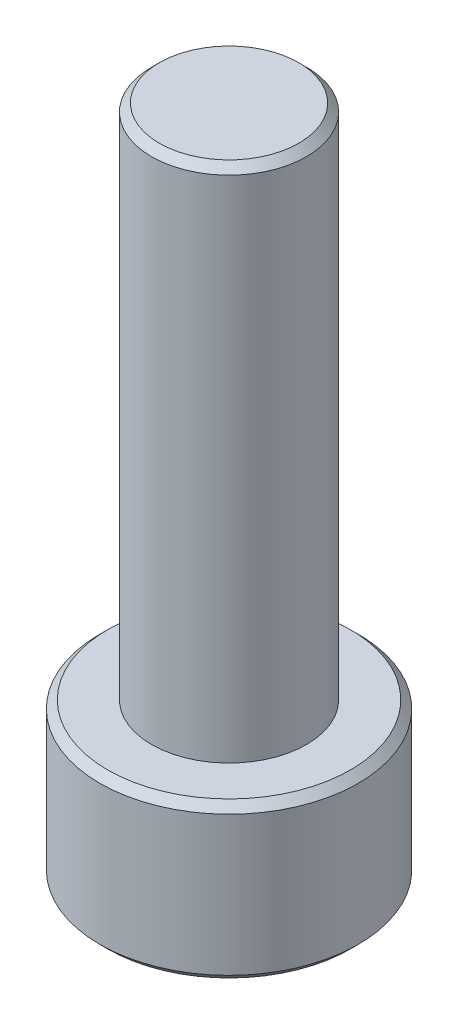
ISO-10303-21;
HEADER;
FILE_DESCRIPTION(('STEP AP214'),'2;1');
FILE_NAME('part.step','',(''),(''),'','','');
FILE_SCHEMA(('AUTOMOTIVE_DESIGN { 1 0 10303 214 1 1 1 1 }'));
ENDSEC;
DATA;
#1=APPLICATION_CONTEXT('core data for automotive mechanical design processes');
#2=APPLICATION_PROTOCOL_DEFINITION('international standard','automotive_design',2000,#1);
#3=PRODUCT_CONTEXT('',#1,'mechanical');
#4=PRODUCT('Part','Part','',(#3));
#5=PRODUCT_RELATED_PRODUCT_CATEGORY('part','',(#4));
#6=PRODUCT_DEFINITION_FORMATION('','',#4);
#7=PRODUCT_DEFINITION_CONTEXT('part definition',#1,'design');
#8=PRODUCT_DEFINITION('design','',#6,#7);
#9=PRODUCT_DEFINITION_SHAPE('','',#8);
#10=(LENGTH_UNIT() NAMED_UNIT(*) SI_UNIT(.MILLI.,.METRE.));
#11=(NAMED_UNIT(*) PLANE_ANGLE_UNIT() SI_UNIT($,.RADIAN.));
#12=(NAMED_UNIT(*) SI_UNIT($,.STERADIAN.) SOLID_ANGLE_UNIT());
#13=UNCERTAINTY_MEASURE_WITH_UNIT(LENGTH_MEASURE(1.E-05),#10,'distance_accuracy_value','');
#14=(GEOMETRIC_REPRESENTATION_CONTEXT(3) GLOBAL_UNCERTAINTY_ASSIGNED_CONTEXT((#13)) GLOBAL_UNIT_ASSIGNED_CONTEXT((#10,
#11,#12)) REPRESENTATION_CONTEXT('',''));
#15=CARTESIAN_POINT('',(0.,0.,0.));
#16=DIRECTION('',(0.,0.,1.));
#17=DIRECTION('',(1.,0.,0.));
#18=AXIS2_PLACEMENT_3D('',#15,#16,#17);
#19=CARTESIAN_POINT('',(0.,6.,0.));
#20=DIRECTION('',(0.,1.,0.));
#21=DIRECTION('',(0.,0.,1.));
#22=AXIS2_PLACEMENT_3D('',#19,#20,#21);
#23=PLANE('',#22);
#24=CARTESIAN_POINT('',(0.,6.,0.));
#25=DIRECTION('',(0.,1.,0.));
#26=DIRECTION('',(0.,0.,1.));
#27=AXIS2_PLACEMENT_3D('',#24,#25,#26);
#28=CIRCLE('',#27,4.70000000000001);
#29=CARTESIAN_POINT('',(0.,6.,4.70000000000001));
#30=VERTEX_POINT('',#29);
#31=EDGE_CURVE('E153',#30,#30,#28,.T.);
#32=ORIENTED_EDGE('',*,*,#31,.T.);
#33=EDGE_LOOP('',(#32));
#34=FACE_BOUND('',#33,.T.);
#35=CARTESIAN_POINT('',(0.,6.,0.));
#36=DIRECTION('',(0.,1.,0.));
#37=DIRECTION('',(0.,0.,1.));
#38=AXIS2_PLACEMENT_3D('',#35,#36,#37);
#39=CIRCLE('',#38,3.);
#40=CARTESIAN_POINT('',(0.,6.,3.));
#41=VERTEX_POINT('',#40);
#42=EDGE_CURVE('E136',#41,#41,#39,.T.);
#43=ORIENTED_EDGE('',*,*,#42,.F.);
#44=EDGE_LOOP('',(#43));
#45=FACE_BOUND('',#44,.T.);
#46=ADVANCED_FACE('F34',(#34,#45),#23,.T.);
#47=CARTESIAN_POINT('',(0.,6.,0.));
#48=DIRECTION('',(0.,-1.,0.));
#49=DIRECTION('',(0.,0.,-1.));
#50=AXIS2_PLACEMENT_3D('',#47,#48,#49);
#51=CYLINDRICAL_SURFACE('',#50,5.);
#52=CARTESIAN_POINT('',(0.,0.300000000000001,0.));
#53=DIRECTION('',(0.,1.,0.));
#54=DIRECTION('',(0.,0.,1.));
#55=AXIS2_PLACEMENT_3D('',#52,#53,#54);
#56=CIRCLE('',#55,5.);
#57=CARTESIAN_POINT('',(0.,0.300000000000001,5.));
#58=VERTEX_POINT('',#57);
#59=EDGE_CURVE('E147',#58,#58,#56,.T.);
#60=ORIENTED_EDGE('',*,*,#59,.T.);
#61=EDGE_LOOP('',(#60));
#62=FACE_BOUND('',#61,.T.);
#63=CARTESIAN_POINT('',(0.,5.70000000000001,0.));
#64=DIRECTION('',(0.,1.,0.));
#65=DIRECTION('',(0.,0.,1.));
#66=AXIS2_PLACEMENT_3D('',#63,#64,#65);
#67=CIRCLE('',#66,5.);
#68=CARTESIAN_POINT('',(0.,5.70000000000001,5.));
#69=VERTEX_POINT('',#68);
#70=EDGE_CURVE('E144',#69,#69,#67,.F.);
#71=ORIENTED_EDGE('',*,*,#70,.T.);
#72=EDGE_LOOP('',(#71));
#73=FACE_BOUND('',#72,.T.);
#74=ADVANCED_FACE('F174',(#62,#73),#51,.T.);
#75=CARTESIAN_POINT('',(0.,0.,0.));
#76=DIRECTION('',(0.,1.,0.));
#77=DIRECTION('',(0.,0.,1.));
#78=AXIS2_PLACEMENT_3D('',#75,#76,#77);
#79=PLANE('',#78);
#80=DIRECTION('',(-0.5,0.,0.866025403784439));
#81=VECTOR('',#80,1.);
#82=CARTESIAN_POINT('',(2.88675134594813,0.,0.));
#83=LINE('',#82,#81);
#84=CARTESIAN_POINT('',(2.88675134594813,0.,0.));
#85=VERTEX_POINT('',#84);
#86=CARTESIAN_POINT('',(1.44337567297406,0.,2.5));
#87=VERTEX_POINT('',#86);
#88=EDGE_CURVE('E123',#85,#87,#83,.T.);
#89=ORIENTED_EDGE('',*,*,#88,.F.);
#90=DIRECTION('',(0.5,0.,0.866025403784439));
#91=VECTOR('',#90,1.);
#92=CARTESIAN_POINT('',(1.44337567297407,0.,-2.5));
#93=LINE('',#92,#91);
#94=CARTESIAN_POINT('',(1.44337567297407,0.,-2.5));
#95=VERTEX_POINT('',#94);
#96=EDGE_CURVE('E49',#95,#85,#93,.T.);
#97=ORIENTED_EDGE('',*,*,#96,.F.);
#98=DIRECTION('',(1.,0.,0.));
#99=VECTOR('',#98,1.);
#100=CARTESIAN_POINT('',(-1.44337567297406,0.,-2.5));
#101=LINE('',#100,#99);
#102=CARTESIAN_POINT('',(-1.44337567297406,0.,-2.5));
#103=VERTEX_POINT('',#102);
#104=EDGE_CURVE('E132',#103,#95,#101,.T.);
#105=ORIENTED_EDGE('',*,*,#104,.F.);
#106=DIRECTION('',(0.5,0.,-0.866025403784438));
#107=VECTOR('',#106,1.);
#108=CARTESIAN_POINT('',(-2.88675134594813,0.,0.));
#109=LINE('',#108,#107);
#110=CARTESIAN_POINT('',(-2.88675134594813,0.,0.));
#111=VERTEX_POINT('',#110);
#112=EDGE_CURVE('E130',#111,#103,#109,.T.);
#113=ORIENTED_EDGE('',*,*,#112,.F.);
#114=DIRECTION('',(-0.5,0.,-0.866025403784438));
#115=VECTOR('',#114,1.);
#116=CARTESIAN_POINT('',(-1.44337567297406,0.,2.5));
#117=LINE('',#116,#115);
#118=CARTESIAN_POINT('',(-1.44337567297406,0.,2.5));
#119=VERTEX_POINT('',#118);
#120=EDGE_CURVE('E97',#119,#111,#117,.T.);
#121=ORIENTED_EDGE('',*,*,#120,.F.);
#122=DIRECTION('',(-1.,0.,0.));
#123=VECTOR('',#122,1.);
#124=CARTESIAN_POINT('',(1.44337567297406,0.,2.5));
#125=LINE('',#124,#123);
#126=EDGE_CURVE('E126',#87,#119,#125,.T.);
#127=ORIENTED_EDGE('',*,*,#126,.F.);
#128=EDGE_LOOP('',(#89,#97,#105,#113,#121,#127));
#129=FACE_BOUND('',#128,.T.);
#130=CARTESIAN_POINT('',(0.,0.,0.));
#131=DIRECTION('',(0.,1.,0.));
#132=DIRECTION('',(0.,0.,1.));
#133=AXIS2_PLACEMENT_3D('',#130,#131,#132);
#134=CIRCLE('',#133,4.7);
#135=CARTESIAN_POINT('',(0.,0.,4.7));
#136=VERTEX_POINT('',#135);
#137=EDGE_CURVE('E150',#136,#136,#134,.F.);
#138=ORIENTED_EDGE('',*,*,#137,.T.);
#139=EDGE_LOOP('',(#138));
#140=FACE_BOUND('',#139,.T.);
#141=ADVANCED_FACE('F180',(#129,#140),#79,.F.);
#142=CARTESIAN_POINT('',(0.,26.,0.));
#143=DIRECTION('',(0.,-1.,0.));
#144=DIRECTION('',(0.,0.,-1.));
#145=AXIS2_PLACEMENT_3D('',#142,#143,#144);
#146=CYLINDRICAL_SURFACE('',#145,3.);
#147=CARTESIAN_POINT('',(0.,25.7,0.));
#148=DIRECTION('',(0.,1.,0.));
#149=DIRECTION('',(0.,0.,1.));
#150=AXIS2_PLACEMENT_3D('',#147,#148,#149);
#151=CIRCLE('',#150,3.);
#152=CARTESIAN_POINT('',(0.,25.7,3.));
#153=VERTEX_POINT('',#152);
#154=EDGE_CURVE('E11',#153,#153,#151,.F.);
#155=ORIENTED_EDGE('',*,*,#154,.T.);
#156=EDGE_LOOP('',(#155));
#157=FACE_BOUND('',#156,.T.);
#158=ORIENTED_EDGE('',*,*,#42,.T.);
#159=EDGE_LOOP('',(#158));
#160=FACE_BOUND('',#159,.T.);
#161=ADVANCED_FACE('F186',(#157,#160),#146,.T.);
#162=CARTESIAN_POINT('',(0.,26.,0.));
#163=DIRECTION('',(0.,1.,0.));
#164=DIRECTION('',(0.,0.,1.));
#165=AXIS2_PLACEMENT_3D('',#162,#163,#164);
#166=PLANE('',#165);
#167=CARTESIAN_POINT('',(0.,26.,0.));
#168=DIRECTION('',(0.,1.,0.));
#169=DIRECTION('',(0.,0.,1.));
#170=AXIS2_PLACEMENT_3D('',#167,#168,#169);
#171=CIRCLE('',#170,2.69999999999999);
#172=CARTESIAN_POINT('',(0.,26.,2.69999999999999));
#173=VERTEX_POINT('',#172);
#174=EDGE_CURVE('E42',#173,#173,#171,.T.);
#175=ORIENTED_EDGE('',*,*,#174,.T.);
#176=EDGE_LOOP('',(#175));
#177=FACE_BOUND('',#176,.T.);
#178=ADVANCED_FACE('F158',(#177),#166,.T.);
#179=CARTESIAN_POINT('',(0.,0.300000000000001,0.));
#180=DIRECTION('',(0.,1.,0.));
#181=DIRECTION('',(0.,0.,1.));
#182=AXIS2_PLACEMENT_3D('',#179,#180,#181);
#183=CONICAL_SURFACE('',#182,5.,0.785398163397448);
#184=CARTESIAN_POINT('',(0.,0.,4.7));
#185=CARTESIAN_POINT('',(0.,0.00312499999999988,4.703125));
#186=CARTESIAN_POINT('',(0.,0.00624999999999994,4.70625));
#187=CARTESIAN_POINT('',(0.,0.0125,4.7125));
#188=CARTESIAN_POINT('',(0.,0.0156250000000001,4.715625));
#189=CARTESIAN_POINT('',(0.,0.0218750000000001,4.721875));
#190=CARTESIAN_POINT('',(0.,0.025,4.725));
#191=CARTESIAN_POINT('',(0.,0.03125,4.73125));
#192=CARTESIAN_POINT('',(0.,0.034375,4.734375));
#193=CARTESIAN_POINT('',(0.,0.0406250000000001,4.740625));
#194=CARTESIAN_POINT('',(0.,0.0437500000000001,4.74375));
#195=CARTESIAN_POINT('',(0.,0.0500000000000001,4.75));
#196=CARTESIAN_POINT('',(0.,0.053125,4.753125));
#197=CARTESIAN_POINT('',(0.,0.0593750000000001,4.759375));
#198=CARTESIAN_POINT('',(0.,0.0625000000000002,4.7625));
#199=CARTESIAN_POINT('',(0.,0.0687500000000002,4.76875));
#200=CARTESIAN_POINT('',(0.,0.071875,4.771875));
#201=CARTESIAN_POINT('',(0.,0.078125,4.778125));
#202=CARTESIAN_POINT('',(0.,0.0812500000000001,4.78125));
#203=CARTESIAN_POINT('',(0.,0.0875000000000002,4.7875));
#204=CARTESIAN_POINT('',(0.,0.0906250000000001,4.790625));
#205=CARTESIAN_POINT('',(0.,0.0968750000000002,4.796875));
#206=CARTESIAN_POINT('',(0.,0.1,4.8));
#207=CARTESIAN_POINT('',(0.,0.10625,4.80625));
#208=CARTESIAN_POINT('',(0.,0.109375,4.809375));
#209=CARTESIAN_POINT('',(0.,0.115625,4.815625));
#210=CARTESIAN_POINT('',(0.,0.11875,4.81875));
#211=CARTESIAN_POINT('',(0.,0.125,4.825));
#212=CARTESIAN_POINT('',(0.,0.128125,4.828125));
#213=CARTESIAN_POINT('',(0.,0.134375,4.834375));
#214=CARTESIAN_POINT('',(0.,0.1375,4.8375));
#215=CARTESIAN_POINT('',(0.,0.14375,4.84375));
#216=CARTESIAN_POINT('',(0.,0.146875,4.846875));
#217=CARTESIAN_POINT('',(0.,0.153125,4.853125));
#218=CARTESIAN_POINT('',(0.,0.15625,4.85625));
#219=CARTESIAN_POINT('',(0.,0.1625,4.8625));
#220=CARTESIAN_POINT('',(0.,0.165625,4.865625));
#221=CARTESIAN_POINT('',(0.,0.171875,4.871875));
#222=CARTESIAN_POINT('',(0.,0.175,4.875));
#223=CARTESIAN_POINT('',(0.,0.18125,4.88125));
#224=CARTESIAN_POINT('',(0.,0.184375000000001,4.884375));
#225=CARTESIAN_POINT('',(0.,0.190625,4.890625));
#226=CARTESIAN_POINT('',(0.,0.19375,4.89375));
#227=CARTESIAN_POINT('',(0.,0.2,4.9));
#228=CARTESIAN_POINT('',(0.,0.203125,4.903125));
#229=CARTESIAN_POINT('',(0.,0.209375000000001,4.909375));
#230=CARTESIAN_POINT('',(0.,0.2125,4.9125));
#231=CARTESIAN_POINT('',(0.,0.21875,4.91875));
#232=CARTESIAN_POINT('',(0.,0.221875,4.921875));
#233=CARTESIAN_POINT('',(0.,0.228125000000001,4.928125));
#234=CARTESIAN_POINT('',(0.,0.231250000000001,4.93125));
#235=CARTESIAN_POINT('',(0.,0.237500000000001,4.9375));
#236=CARTESIAN_POINT('',(0.,0.240625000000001,4.940625));
#237=CARTESIAN_POINT('',(0.,0.246875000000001,4.946875));
#238=CARTESIAN_POINT('',(0.,0.250000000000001,4.95));
#239=CARTESIAN_POINT('',(0.,0.256250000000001,4.95625));
#240=CARTESIAN_POINT('',(0.,0.259375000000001,4.959375));
#241=CARTESIAN_POINT('',(0.,0.265625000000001,4.965625));
#242=CARTESIAN_POINT('',(0.,0.268750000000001,4.96875));
#243=CARTESIAN_POINT('',(0.,0.275000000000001,4.975));
#244=CARTESIAN_POINT('',(0.,0.278125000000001,4.978125));
#245=CARTESIAN_POINT('',(0.,0.284375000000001,4.984375));
#246=CARTESIAN_POINT('',(0.,0.287500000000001,4.9875));
#247=CARTESIAN_POINT('',(0.,0.293750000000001,4.99375));
#248=CARTESIAN_POINT('',(0.,0.296875,4.996875));
#249=CARTESIAN_POINT('',(0.,0.300000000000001,5.));
#250=B_SPLINE_CURVE_WITH_KNOTS('',3,(#184,#185,#186,#187,#188,#189,#190,#191,#192,#193,#194,
#195,#196,#197,#198,#199,#200,#201,#202,#203,#204,#205,#206,#207,#208,#209,#210,#211,#212,#213,
#214,#215,#216,#217,#218,#219,#220,#221,#222,#223,#224,#225,#226,#227,#228,#229,#230,#231,#232,
#233,#234,#235,#236,#237,#238,#239,#240,#241,#242,#243,#244,#245,#246,#247,#248,#249),
.UNSPECIFIED.,.F.,.F.,(4,2,2,2,2,2,2,2,2,2,2,2,2,2,2,2,2,2,2,2,2,2,2,2,2,2,2,2,2,2,2,2,4),(0.,
0.0132582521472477,0.0265165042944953,0.0397747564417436,0.0530330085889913,0.066291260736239,
0.0795495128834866,0.0928077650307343,0.106066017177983,0.11932426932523,0.132582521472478,
0.145840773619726,0.159099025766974,0.172357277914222,0.185615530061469,0.198873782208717,
0.212132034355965,0.225390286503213,0.23864853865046,0.251906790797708,0.265165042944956,
0.278423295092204,0.291681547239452,0.304939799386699,0.318198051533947,0.331456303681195,
0.344714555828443,0.357972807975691,0.371231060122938,0.384489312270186,0.397747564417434,
0.411005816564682,0.42426406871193),.UNSPECIFIED.);
#251=EDGE_CURVE('BSEAM170',#136,#58,#250,.T.);
#252=ORIENTED_EDGE('',*,*,#137,.F.);
#253=ORIENTED_EDGE('',*,*,#59,.F.);
#254=ORIENTED_EDGE('',*,*,#251,.T.);
#255=ORIENTED_EDGE('',*,*,#251,.F.);
#256=EDGE_LOOP('',(#252,#254,#253,#255));
#257=FACE_BOUND('',#256,.T.);
#258=ADVANCED_FACE('F170',(#257),#183,.T.);
#259=CARTESIAN_POINT('',(0.,6.,0.));
#260=DIRECTION('',(0.,-1.,0.));
#261=DIRECTION('',(0.,0.,-1.));
#262=AXIS2_PLACEMENT_3D('',#259,#260,#261);
#263=CONICAL_SURFACE('',#262,4.70000000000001,0.785398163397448);
#264=ORIENTED_EDGE('',*,*,#70,.F.);
#265=EDGE_LOOP('',(#264));
#266=FACE_BOUND('',#265,.T.);
#267=ORIENTED_EDGE('',*,*,#31,.F.);
#268=EDGE_LOOP('',(#267));
#269=FACE_BOUND('',#268,.T.);
#270=ADVANCED_FACE('F162',(#266,#269),#263,.T.);
#271=CARTESIAN_POINT('',(0.,26.,0.));
#272=DIRECTION('',(0.,-1.,0.));
#273=DIRECTION('',(0.,0.,-1.));
#274=AXIS2_PLACEMENT_3D('',#271,#272,#273);
#275=CONICAL_SURFACE('',#274,2.69999999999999,0.78539816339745);
#276=ORIENTED_EDGE('',*,*,#154,.F.);
#277=EDGE_LOOP('',(#276));
#278=FACE_BOUND('',#277,.T.);
#279=ORIENTED_EDGE('',*,*,#174,.F.);
#280=EDGE_LOOP('',(#279));
#281=FACE_BOUND('',#280,.T.);
#282=ADVANCED_FACE('F36',(#278,#281),#275,.T.);
#283=CARTESIAN_POINT('',(1.44337567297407,3.,-2.5));
#284=DIRECTION('',(0.866025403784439,0.,-0.5));
#285=DIRECTION('',(-0.5,0.,-0.866025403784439));
#286=AXIS2_PLACEMENT_3D('',#283,#284,#285);
#287=PLANE('',#286);
#288=ORIENTED_EDGE('',*,*,#96,.T.);
#289=DIRECTION('',(0.,-1.,0.));
#290=VECTOR('',#289,1.);
#291=CARTESIAN_POINT('',(2.88675134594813,3.,0.));
#292=LINE('',#291,#290);
#293=CARTESIAN_POINT('',(2.88675134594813,3.,0.));
#294=VERTEX_POINT('',#293);
#295=EDGE_CURVE('E79',#294,#85,#292,.T.);
#296=ORIENTED_EDGE('',*,*,#295,.F.);
#297=DIRECTION('',(0.5,0.,0.866025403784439));
#298=VECTOR('',#297,1.);
#299=CARTESIAN_POINT('',(1.44337567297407,3.,-2.5));
#300=LINE('',#299,#298);
#301=CARTESIAN_POINT('',(1.44337567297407,3.,-2.5));
#302=VERTEX_POINT('',#301);
#303=EDGE_CURVE('E134',#302,#294,#300,.T.);
#304=ORIENTED_EDGE('',*,*,#303,.F.);
#305=DIRECTION('',(0.,-1.,0.));
#306=VECTOR('',#305,1.);
#307=CARTESIAN_POINT('',(1.44337567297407,3.,-2.5));
#308=LINE('',#307,#306);
#309=EDGE_CURVE('E57',#302,#95,#308,.T.);
#310=ORIENTED_EDGE('',*,*,#309,.T.);
#311=EDGE_LOOP('',(#288,#296,#304,#310));
#312=FACE_BOUND('',#311,.T.);
#313=ADVANCED_FACE('F161',(#312),#287,.F.);
#314=CARTESIAN_POINT('',(-1.44337567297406,3.,-2.5));
#315=DIRECTION('',(0.,0.,-1.));
#316=DIRECTION('',(-1.,0.,0.));
#317=AXIS2_PLACEMENT_3D('',#314,#315,#316);
#318=PLANE('',#317);
#319=ORIENTED_EDGE('',*,*,#104,.T.);
#320=ORIENTED_EDGE('',*,*,#309,.F.);
#321=DIRECTION('',(1.,0.,0.));
#322=VECTOR('',#321,1.);
#323=CARTESIAN_POINT('',(-1.44337567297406,3.,-2.5));
#324=LINE('',#323,#322);
#325=CARTESIAN_POINT('',(-1.44337567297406,3.,-2.5));
#326=VERTEX_POINT('',#325);
#327=EDGE_CURVE('E109',#326,#302,#324,.T.);
#328=ORIENTED_EDGE('',*,*,#327,.F.);
#329=DIRECTION('',(0.,-1.,0.));
#330=VECTOR('',#329,1.);
#331=CARTESIAN_POINT('',(-1.44337567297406,3.,-2.5));
#332=LINE('',#331,#330);
#333=EDGE_CURVE('E101',#326,#103,#332,.T.);
#334=ORIENTED_EDGE('',*,*,#333,.T.);
#335=EDGE_LOOP('',(#319,#320,#328,#334));
#336=FACE_BOUND('',#335,.T.);
#337=ADVANCED_FACE('F168',(#336),#318,.F.);
#338=CARTESIAN_POINT('',(-2.88675134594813,3.,0.));
#339=DIRECTION('',(-0.866025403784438,0.,-0.5));
#340=DIRECTION('',(-0.5,0.,0.866025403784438));
#341=AXIS2_PLACEMENT_3D('',#338,#339,#340);
#342=PLANE('',#341);
#343=ORIENTED_EDGE('',*,*,#112,.T.);
#344=ORIENTED_EDGE('',*,*,#333,.F.);
#345=DIRECTION('',(0.5,0.,-0.866025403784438));
#346=VECTOR('',#345,1.);
#347=CARTESIAN_POINT('',(-2.88675134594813,3.,0.));
#348=LINE('',#347,#346);
#349=CARTESIAN_POINT('',(-2.88675134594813,3.,0.));
#350=VERTEX_POINT('',#349);
#351=EDGE_CURVE('E105',#350,#326,#348,.T.);
#352=ORIENTED_EDGE('',*,*,#351,.F.);
#353=DIRECTION('',(0.,-1.,0.));
#354=VECTOR('',#353,1.);
#355=CARTESIAN_POINT('',(-2.88675134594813,3.,0.));
#356=LINE('',#355,#354);
#357=EDGE_CURVE('E90',#350,#111,#356,.T.);
#358=ORIENTED_EDGE('',*,*,#357,.T.);
#359=EDGE_LOOP('',(#343,#344,#352,#358));
#360=FACE_BOUND('',#359,.T.);
#361=ADVANCED_FACE('F106',(#360),#342,.F.);
#362=CARTESIAN_POINT('',(-1.44337567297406,3.,2.5));
#363=DIRECTION('',(-0.866025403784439,0.,0.5));
#364=DIRECTION('',(0.5,0.,0.866025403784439));
#365=AXIS2_PLACEMENT_3D('',#362,#363,#364);
#366=PLANE('',#365);
#367=ORIENTED_EDGE('',*,*,#120,.T.);
#368=ORIENTED_EDGE('',*,*,#357,.F.);
#369=DIRECTION('',(-0.5,0.,-0.866025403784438));
#370=VECTOR('',#369,1.);
#371=CARTESIAN_POINT('',(-1.44337567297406,3.,2.5));
#372=LINE('',#371,#370);
#373=CARTESIAN_POINT('',(-1.44337567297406,3.,2.5));
#374=VERTEX_POINT('',#373);
#375=EDGE_CURVE('E94',#374,#350,#372,.T.);
#376=ORIENTED_EDGE('',*,*,#375,.F.);
#377=DIRECTION('',(0.,-1.,0.));
#378=VECTOR('',#377,1.);
#379=CARTESIAN_POINT('',(-1.44337567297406,3.,2.5));
#380=LINE('',#379,#378);
#381=EDGE_CURVE('E102',#374,#119,#380,.T.);
#382=ORIENTED_EDGE('',*,*,#381,.T.);
#383=EDGE_LOOP('',(#367,#368,#376,#382));
#384=FACE_BOUND('',#383,.T.);
#385=ADVANCED_FACE('F92',(#384),#366,.F.);
#386=CARTESIAN_POINT('',(1.44337567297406,3.,2.5));
#387=DIRECTION('',(0.,0.,1.));
#388=DIRECTION('',(1.,0.,0.));
#389=AXIS2_PLACEMENT_3D('',#386,#387,#388);
#390=PLANE('',#389);
#391=ORIENTED_EDGE('',*,*,#126,.T.);
#392=ORIENTED_EDGE('',*,*,#381,.F.);
#393=DIRECTION('',(-1.,0.,0.));
#394=VECTOR('',#393,1.);
#395=CARTESIAN_POINT('',(1.44337567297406,3.,2.5));
#396=LINE('',#395,#394);
#397=CARTESIAN_POINT('',(1.44337567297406,3.,2.5));
#398=VERTEX_POINT('',#397);
#399=EDGE_CURVE('E115',#398,#374,#396,.T.);
#400=ORIENTED_EDGE('',*,*,#399,.F.);
#401=DIRECTION('',(0.,-1.,0.));
#402=VECTOR('',#401,1.);
#403=CARTESIAN_POINT('',(1.44337567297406,3.,2.5));
#404=LINE('',#403,#402);
#405=EDGE_CURVE('E139',#398,#87,#404,.T.);
#406=ORIENTED_EDGE('',*,*,#405,.T.);
#407=EDGE_LOOP('',(#391,#392,#400,#406));
#408=FACE_BOUND('',#407,.T.);
#409=ADVANCED_FACE('F212',(#408),#390,.F.);
#410=CARTESIAN_POINT('',(2.88675134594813,3.,0.));
#411=DIRECTION('',(0.866025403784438,0.,0.5));
#412=DIRECTION('',(0.5,0.,-0.866025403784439));
#413=AXIS2_PLACEMENT_3D('',#410,#411,#412);
#414=PLANE('',#413);
#415=ORIENTED_EDGE('',*,*,#88,.T.);
#416=ORIENTED_EDGE('',*,*,#405,.F.);
#417=DIRECTION('',(-0.5,0.,0.866025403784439));
#418=VECTOR('',#417,1.);
#419=CARTESIAN_POINT('',(2.88675134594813,3.,0.));
#420=LINE('',#419,#418);
#421=EDGE_CURVE('E117',#294,#398,#420,.T.);
#422=ORIENTED_EDGE('',*,*,#421,.F.);
#423=ORIENTED_EDGE('',*,*,#295,.T.);
#424=EDGE_LOOP('',(#415,#416,#422,#423));
#425=FACE_BOUND('',#424,.T.);
#426=ADVANCED_FACE('F209',(#425),#414,.F.);
#427=CARTESIAN_POINT('',(2.88675134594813,3.,0.));
#428=DIRECTION('',(0.,-1.,0.));
#429=DIRECTION('',(0.,0.,-1.));
#430=AXIS2_PLACEMENT_3D('',#427,#428,#429);
#431=PLANE('',#430);
#432=ORIENTED_EDGE('',*,*,#303,.T.);
#433=ORIENTED_EDGE('',*,*,#421,.T.);
#434=ORIENTED_EDGE('',*,*,#399,.T.);
#435=ORIENTED_EDGE('',*,*,#375,.T.);
#436=ORIENTED_EDGE('',*,*,#351,.T.);
#437=ORIENTED_EDGE('',*,*,#327,.T.);
#438=EDGE_LOOP('',(#432,#433,#434,#435,#436,#437));
#439=FACE_BOUND('',#438,.T.);
#440=ADVANCED_FACE('F112',(#439),#431,.T.);
#441=CLOSED_SHELL('',(#46,#74,#141,#161,#178,#258,#270,#282,#313,#337,#361,#385,#409,#426,#440));
#442=MANIFOLD_SOLID_BREP('B2',#441);
#443=ADVANCED_BREP_SHAPE_REPRESENTATION('',(#18,#442),#14);
#444=SHAPE_DEFINITION_REPRESENTATION(#9,#443);
ENDSEC;
END-ISO-10303-21;
